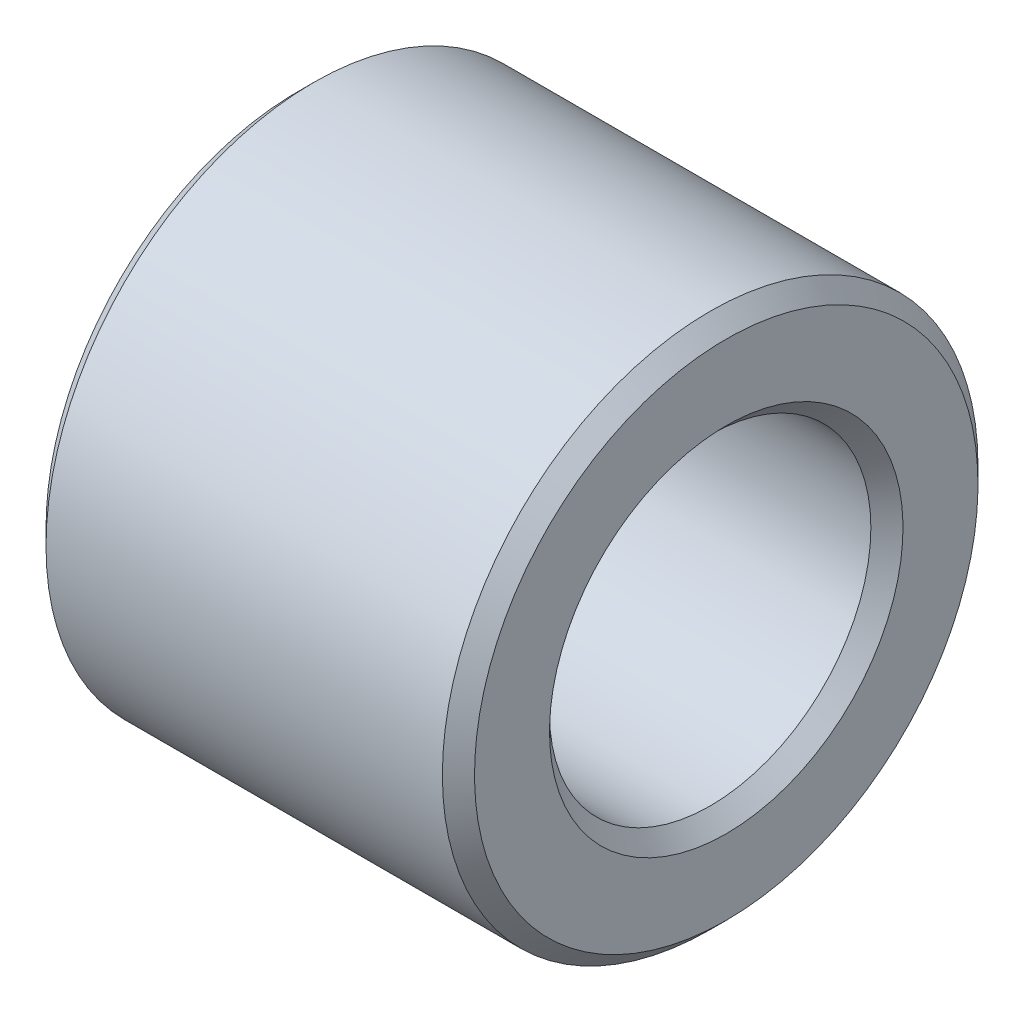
ISO-10303-21;
HEADER;
FILE_DESCRIPTION(('STEP AP214'),'2;1');
FILE_NAME('part.step','',(''),(''),'','','');
FILE_SCHEMA(('AUTOMOTIVE_DESIGN { 1 0 10303 214 1 1 1 1 }'));
ENDSEC;
DATA;
#1=APPLICATION_CONTEXT('core data for automotive mechanical design processes');
#2=APPLICATION_PROTOCOL_DEFINITION('international standard','automotive_design',2000,#1);
#3=PRODUCT_CONTEXT('',#1,'mechanical');
#4=PRODUCT('Part','Part','',(#3));
#5=PRODUCT_RELATED_PRODUCT_CATEGORY('part','',(#4));
#6=PRODUCT_DEFINITION_FORMATION('','',#4);
#7=PRODUCT_DEFINITION_CONTEXT('part definition',#1,'design');
#8=PRODUCT_DEFINITION('design','',#6,#7);
#9=PRODUCT_DEFINITION_SHAPE('','',#8);
#10=(LENGTH_UNIT() NAMED_UNIT(*) SI_UNIT(.MILLI.,.METRE.));
#11=(NAMED_UNIT(*) PLANE_ANGLE_UNIT() SI_UNIT($,.RADIAN.));
#12=(NAMED_UNIT(*) SI_UNIT($,.STERADIAN.) SOLID_ANGLE_UNIT());
#13=UNCERTAINTY_MEASURE_WITH_UNIT(LENGTH_MEASURE(1.E-05),#10,'distance_accuracy_value','');
#14=(GEOMETRIC_REPRESENTATION_CONTEXT(3) GLOBAL_UNCERTAINTY_ASSIGNED_CONTEXT((#13)) GLOBAL_UNIT_ASSIGNED_CONTEXT((#10,
#11,#12)) REPRESENTATION_CONTEXT('',''));
#15=CARTESIAN_POINT('',(0.,0.,0.));
#16=DIRECTION('',(0.,0.,1.));
#17=DIRECTION('',(1.,0.,0.));
#18=AXIS2_PLACEMENT_3D('',#15,#16,#17);
#19=CARTESIAN_POINT('',(0.,0.,0.));
#20=DIRECTION('',(-1.,0.,0.));
#21=DIRECTION('',(0.,-1.,0.));
#22=AXIS2_PLACEMENT_3D('',#19,#20,#21);
#23=CONICAL_SURFACE('',#22,3.3,0.785398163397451);
#24=CARTESIAN_POINT('',(0.300000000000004,0.,0.));
#25=DIRECTION('',(-1.,0.,0.));
#26=DIRECTION('',(0.,-1.,0.));
#27=AXIS2_PLACEMENT_3D('',#24,#25,#26);
#28=CIRCLE('',#27,3.);
#29=CARTESIAN_POINT('',(0.300000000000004,-3.,0.));
#30=VERTEX_POINT('',#29);
#31=EDGE_CURVE('E64',#30,#30,#28,.T.);
#32=ORIENTED_EDGE('',*,*,#31,.F.);
#33=EDGE_LOOP('',(#32));
#34=FACE_BOUND('',#33,.T.);
#35=CARTESIAN_POINT('',(0.,0.,0.));
#36=DIRECTION('',(-1.,0.,0.));
#37=DIRECTION('',(0.,-1.,0.));
#38=AXIS2_PLACEMENT_3D('',#35,#36,#37);
#39=CIRCLE('',#38,3.3);
#40=CARTESIAN_POINT('',(0.,-3.3,0.));
#41=VERTEX_POINT('',#40);
#42=EDGE_CURVE('E10',#41,#41,#39,.T.);
#43=ORIENTED_EDGE('',*,*,#42,.T.);
#44=EDGE_LOOP('',(#43));
#45=FACE_BOUND('',#44,.T.);
#46=ADVANCED_FACE('F36',(#34,#45),#23,.F.);
#47=CARTESIAN_POINT('',(0.,3.3,0.));
#48=DIRECTION('',(1.,0.,0.));
#49=DIRECTION('',(0.,1.,0.));
#50=AXIS2_PLACEMENT_3D('',#47,#48,#49);
#51=PLANE('',#50);
#52=ORIENTED_EDGE('',*,*,#42,.F.);
#53=EDGE_LOOP('',(#52));
#54=FACE_BOUND('',#53,.T.);
#55=CARTESIAN_POINT('',(0.,0.,0.));
#56=DIRECTION('',(-1.,0.,0.));
#57=DIRECTION('',(0.,-1.,0.));
#58=AXIS2_PLACEMENT_3D('',#55,#56,#57);
#59=CIRCLE('',#58,4.7);
#60=CARTESIAN_POINT('',(0.,-4.7,0.));
#61=VERTEX_POINT('',#60);
#62=EDGE_CURVE('E42',#61,#61,#59,.T.);
#63=ORIENTED_EDGE('',*,*,#62,.T.);
#64=EDGE_LOOP('',(#63));
#65=FACE_BOUND('',#64,.T.);
#66=ADVANCED_FACE('F71',(#54,#65),#51,.F.);
#67=CARTESIAN_POINT('',(0.300000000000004,0.,0.));
#68=DIRECTION('',(1.,0.,0.));
#69=DIRECTION('',(0.,1.,0.));
#70=AXIS2_PLACEMENT_3D('',#67,#68,#69);
#71=CONICAL_SURFACE('',#70,5.,0.785398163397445);
#72=ORIENTED_EDGE('',*,*,#62,.F.);
#73=EDGE_LOOP('',(#72));
#74=FACE_BOUND('',#73,.T.);
#75=CARTESIAN_POINT('',(0.300000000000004,0.,0.));
#76=DIRECTION('',(-1.,0.,0.));
#77=DIRECTION('',(0.,-1.,0.));
#78=AXIS2_PLACEMENT_3D('',#75,#76,#77);
#79=CIRCLE('',#78,5.);
#80=CARTESIAN_POINT('',(0.300000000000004,-5.,0.));
#81=VERTEX_POINT('',#80);
#82=EDGE_CURVE('E46',#81,#81,#79,.T.);
#83=ORIENTED_EDGE('',*,*,#82,.T.);
#84=EDGE_LOOP('',(#83));
#85=FACE_BOUND('',#84,.T.);
#86=ADVANCED_FACE('F75',(#74,#85),#71,.T.);
#87=CARTESIAN_POINT('',(0.,0.,0.));
#88=DIRECTION('',(-1.,0.,0.));
#89=DIRECTION('',(0.,-1.,0.));
#90=AXIS2_PLACEMENT_3D('',#87,#88,#89);
#91=CYLINDRICAL_SURFACE('',#90,5.);
#92=ORIENTED_EDGE('',*,*,#82,.F.);
#93=EDGE_LOOP('',(#92));
#94=FACE_BOUND('',#93,.T.);
#95=CARTESIAN_POINT('',(7.7,0.,0.));
#96=DIRECTION('',(-1.,0.,0.));
#97=DIRECTION('',(0.,-1.,0.));
#98=AXIS2_PLACEMENT_3D('',#95,#96,#97);
#99=CIRCLE('',#98,5.);
#100=CARTESIAN_POINT('',(7.7,-5.,0.));
#101=VERTEX_POINT('',#100);
#102=EDGE_CURVE('E50',#101,#101,#99,.T.);
#103=ORIENTED_EDGE('',*,*,#102,.T.);
#104=EDGE_LOOP('',(#103));
#105=FACE_BOUND('',#104,.T.);
#106=ADVANCED_FACE('F80',(#94,#105),#91,.T.);
#107=CARTESIAN_POINT('',(8.,0.,0.));
#108=DIRECTION('',(-1.,0.,0.));
#109=DIRECTION('',(0.,-1.,0.));
#110=AXIS2_PLACEMENT_3D('',#107,#108,#109);
#111=CONICAL_SURFACE('',#110,4.7,0.785398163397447);
#112=ORIENTED_EDGE('',*,*,#102,.F.);
#113=EDGE_LOOP('',(#112));
#114=FACE_BOUND('',#113,.T.);
#115=CARTESIAN_POINT('',(8.,0.,0.));
#116=DIRECTION('',(-1.,0.,0.));
#117=DIRECTION('',(0.,-1.,0.));
#118=AXIS2_PLACEMENT_3D('',#115,#116,#117);
#119=CIRCLE('',#118,4.7);
#120=CARTESIAN_POINT('',(8.,-4.7,0.));
#121=VERTEX_POINT('',#120);
#122=EDGE_CURVE('E55',#121,#121,#119,.T.);
#123=ORIENTED_EDGE('',*,*,#122,.T.);
#124=EDGE_LOOP('',(#123));
#125=FACE_BOUND('',#124,.T.);
#126=ADVANCED_FACE('F86',(#114,#125),#111,.T.);
#127=CARTESIAN_POINT('',(8.,4.7,0.));
#128=DIRECTION('',(-1.,0.,0.));
#129=DIRECTION('',(0.,-1.,0.));
#130=AXIS2_PLACEMENT_3D('',#127,#128,#129);
#131=PLANE('',#130);
#132=ORIENTED_EDGE('',*,*,#122,.F.);
#133=EDGE_LOOP('',(#132));
#134=FACE_BOUND('',#133,.T.);
#135=CARTESIAN_POINT('',(8.,0.,0.));
#136=DIRECTION('',(-1.,0.,0.));
#137=DIRECTION('',(0.,-1.,0.));
#138=AXIS2_PLACEMENT_3D('',#135,#136,#137);
#139=CIRCLE('',#138,3.30000000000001);
#140=CARTESIAN_POINT('',(8.,-3.30000000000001,0.));
#141=VERTEX_POINT('',#140);
#142=EDGE_CURVE('E58',#141,#141,#139,.T.);
#143=ORIENTED_EDGE('',*,*,#142,.T.);
#144=EDGE_LOOP('',(#143));
#145=FACE_BOUND('',#144,.T.);
#146=ADVANCED_FACE('F90',(#134,#145),#131,.F.);
#147=CARTESIAN_POINT('',(7.7,0.,0.));
#148=DIRECTION('',(1.,0.,0.));
#149=DIRECTION('',(0.,1.,0.));
#150=AXIS2_PLACEMENT_3D('',#147,#148,#149);
#151=CONICAL_SURFACE('',#150,3.,0.785398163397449);
#152=ORIENTED_EDGE('',*,*,#142,.F.);
#153=EDGE_LOOP('',(#152));
#154=FACE_BOUND('',#153,.T.);
#155=CARTESIAN_POINT('',(7.7,0.,0.));
#156=DIRECTION('',(-1.,0.,0.));
#157=DIRECTION('',(0.,-1.,0.));
#158=AXIS2_PLACEMENT_3D('',#155,#156,#157);
#159=CIRCLE('',#158,3.);
#160=CARTESIAN_POINT('',(7.7,-3.,0.));
#161=VERTEX_POINT('',#160);
#162=EDGE_CURVE('E61',#161,#161,#159,.T.);
#163=ORIENTED_EDGE('',*,*,#162,.T.);
#164=EDGE_LOOP('',(#163));
#165=FACE_BOUND('',#164,.T.);
#166=ADVANCED_FACE('F94',(#154,#165),#151,.F.);
#167=CARTESIAN_POINT('',(0.,0.,0.));
#168=DIRECTION('',(-1.,0.,0.));
#169=DIRECTION('',(0.,-1.,0.));
#170=AXIS2_PLACEMENT_3D('',#167,#168,#169);
#171=CYLINDRICAL_SURFACE('',#170,3.);
#172=ORIENTED_EDGE('',*,*,#162,.F.);
#173=EDGE_LOOP('',(#172));
#174=FACE_BOUND('',#173,.T.);
#175=ORIENTED_EDGE('',*,*,#31,.T.);
#176=EDGE_LOOP('',(#175));
#177=FACE_BOUND('',#176,.T.);
#178=ADVANCED_FACE('F68',(#174,#177),#171,.F.);
#179=CLOSED_SHELL('',(#46,#66,#86,#106,#126,#146,#166,#178));
#180=MANIFOLD_SOLID_BREP('B2',#179);
#181=ADVANCED_BREP_SHAPE_REPRESENTATION('',(#18,#180),#14);
#182=SHAPE_DEFINITION_REPRESENTATION(#9,#181);
ENDSEC;
END-ISO-10303-21;
